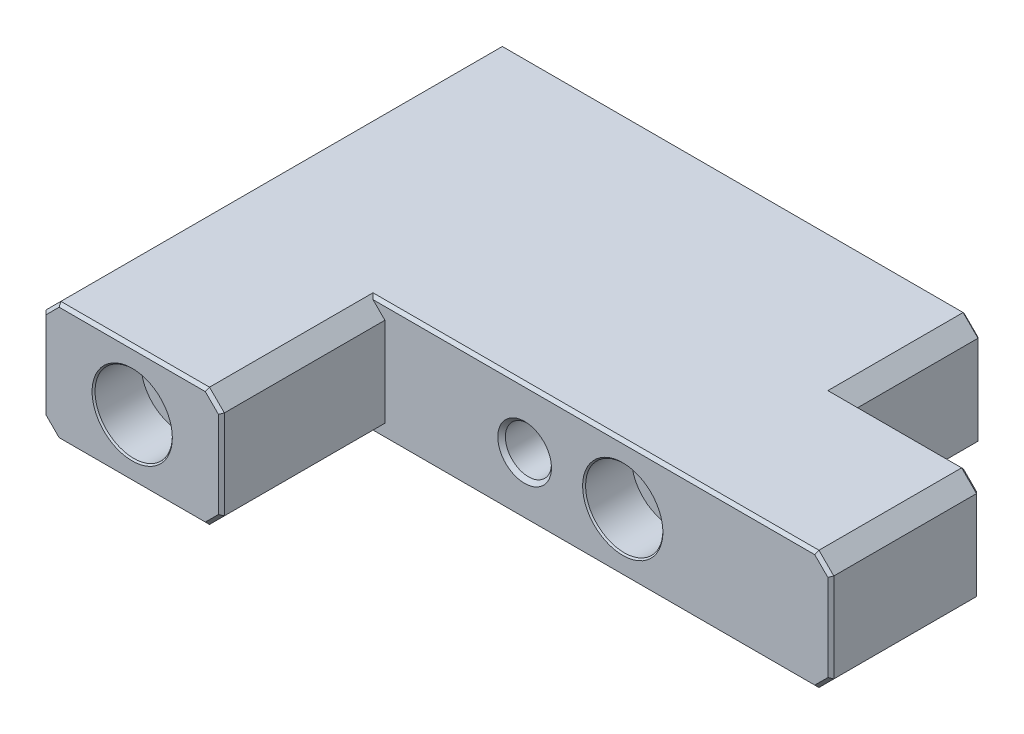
from build123d import *

# Parameters (mm, degrees)
ESQUISSE1_W                          = 210
ESQUISSE1_H                          = 40
VOLUME_DEPTH                         = 150
ESQUISSE5_W                          = 170
ESQUISSE5_H                          = 75
ESQUISSE5_W_2                        = 65
ESQUISSE5_H_2                        = 70
ENL_V_MAT_EXTRU_1_DEPTH              = 262.151297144
LAMAGE_VIS_M16_D                     = 17.5
LAMAGE_VIS_M16_CBORE_D               = 26
LAMAGE_VIS_M16_CBORE_DEPTH           = 16
LAMAGE_VIS_M16_ON_FACE_2_D           = 17.5
LAMAGE_VIS_M16_ON_FACE_2_CBORE_D     = 26
LAMAGE_VIS_M16_ON_FACE_2_CBORE_DEPTH = 16
TROU_TARAUD_M18_D                    = 15.5
TROU_TARAUD_M18_DEPTH                = 48.5
TROU_TARAUD_M18_CSINK_D              = 18.05
TROU_TARAUD_M18_CSINK_ANGLE          = 90
TROU_TARAUD_M18_TIP                  = 4.656669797
TROU_TARAUD_M16_BUT_E_D              = 14
TROU_TARAUD_M16_BUT_E_DEPTH          = 25
TROU_TARAUD_M16_BUT_E_CSINK_D        = 16.05
TROU_TARAUD_M16_BUT_E_CSINK_ANGLE    = 90
TROU_TARAUD_M16_BUT_E_TIP            = 4.206024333
CHANFREINS_5MM_SIZE                  = 5
CHANFREINS_1MM_SIZE                  = 1
CHANFREINS_0_5MM_SIZE                = 0.5


with BuildPart() as part:
    # Esquisse1 → Volume (new body)
    with BuildSketch(Plane.XY):
        with Locations((105, 20)):
            Rectangle(ESQUISSE1_W, ESQUISSE1_H)
    extrude(amount=VOLUME_DEPTH)

    # Esquisse5 → Enl_v. mat.-Extru.1 (cut, through all)
    with BuildSketch(Plane(origin=(0, 40, 0), x_dir=(1, 0, 0), z_dir=(0, 1, 0))):
        with Locations((145, -132.5)):
            Rectangle(ESQUISSE5_W, ESQUISSE5_H)
        with Locations((197.5, -10)):
            Rectangle(ESQUISSE5_W_2, ESQUISSE5_H_2)
    extrude(amount=-ENL_V_MAT_EXTRU_1_DEPTH, mode=Mode.SUBTRACT)

    # Lamage vis M16 (through all)
    with Locations(Plane(origin=(30, 20, 150), x_dir=(1, 0, 0), z_dir=(0, 0, 1))):
        with Locations((0, 0)):
            CounterBoreHole(LAMAGE_VIS_M16_D / 2, LAMAGE_VIS_M16_CBORE_D / 2, LAMAGE_VIS_M16_CBORE_DEPTH)

    # Lamage vis M16 on face 2 (through all)
    with Locations(Plane(origin=(140, 20, 95), x_dir=(1, 0, 0), z_dir=(0, 0, 1))):
        with Locations((0, 0)):
            CounterBoreHole(LAMAGE_VIS_M16_ON_FACE_2_D / 2, LAMAGE_VIS_M16_ON_FACE_2_CBORE_D / 2, LAMAGE_VIS_M16_ON_FACE_2_CBORE_DEPTH)

    # Trou taraud_ M18
    with Locations(Plane(origin=(107, 20, 95), x_dir=(1, 0, 0), z_dir=(0, 0, 1))):
        with Locations((0, 0)):
            CounterSinkHole(TROU_TARAUD_M18_D / 2, TROU_TARAUD_M18_CSINK_D / 2, depth=TROU_TARAUD_M18_DEPTH, counter_sink_angle=TROU_TARAUD_M18_CSINK_ANGLE)
            with Locations((0, 0, -(TROU_TARAUD_M18_DEPTH + TROU_TARAUD_M18_TIP / 2))):  # 118° drill point
                Cone(0, TROU_TARAUD_M18_D / 2, TROU_TARAUD_M18_TIP, mode=Mode.SUBTRACT)

    # Trou taraud_ M16 - But_e
    with Locations(Plane.XZ):
        with Locations((190, 70)):
            CounterSinkHole(TROU_TARAUD_M16_BUT_E_D / 2, TROU_TARAUD_M16_BUT_E_CSINK_D / 2, depth=TROU_TARAUD_M16_BUT_E_DEPTH, counter_sink_angle=TROU_TARAUD_M16_BUT_E_CSINK_ANGLE)
            with Locations((0, 0, -(TROU_TARAUD_M16_BUT_E_DEPTH + TROU_TARAUD_M16_BUT_E_TIP / 2))):  # 118° drill point
                Cone(0, TROU_TARAUD_M16_BUT_E_D / 2, TROU_TARAUD_M16_BUT_E_TIP, mode=Mode.SUBTRACT)

    # Chanfreins 5mm
    chanfreins_5mm_edges = [part.edges().sort_by_distance(p)[0] for p in [
        (210, 40, 70),
        (210, 0, 70),
        (60, 40, 122.5),
        (60, 0, 122.5),
        (165, 0, 22.5),
        (165, 40, 22.5),
        (0, 0, 75),
        (0, 40, 75),
    ]]
    chamfer(chanfreins_5mm_edges, length=CHANFREINS_5MM_SIZE)

    # Chanfreins 1mm
    chanfreins_1mm_edges = [part.edges().sort_by_distance(p)[0] for p in [
        (182.5, 0, 45),
        (182.5, 40, 45),
        (130, 0, 95),
        (30, 0, 150),
        (30, 40, 150),
        (130, 40, 95),
        (210, 20, 45),
        (210, 20, 95),
        (207.5, 37.5, 45),
        (207.5, 2.5, 45),
        (207.5, 37.5, 95),
        (207.5, 2.5, 95),
        (60, 20, 150),
        (0, 20, 150),
        (2.5, 37.5, 150),
        (2.5, 2.5, 150),
        (57.5, 2.5, 150),
        (57.5, 37.5, 150),
    ]]
    chamfer(chanfreins_1mm_edges, length=CHANFREINS_1MM_SIZE)

    # Chanfreins 0.5mm
    chanfreins_0_5mm_edges = [part.edges().sort_by_distance(p)[0] for p in [
        (127, 20, 95),
        (148.75, 20, 0),
        (17, 20, 150),
        (38.75, 20, 0),
        (82.5, 0, 0),
        (165, 20, 0),
        (82.5, 40, 0),
        (0, 20, 0),
        (2.5, 37.5, 0),
        (2.5, 2.5, 0),
        (162.5, 37.5, 0),
        (162.5, 2.5, 0),
    ]]
    chamfer(chanfreins_0_5mm_edges, length=CHANFREINS_0_5MM_SIZE)


solid = part.part
